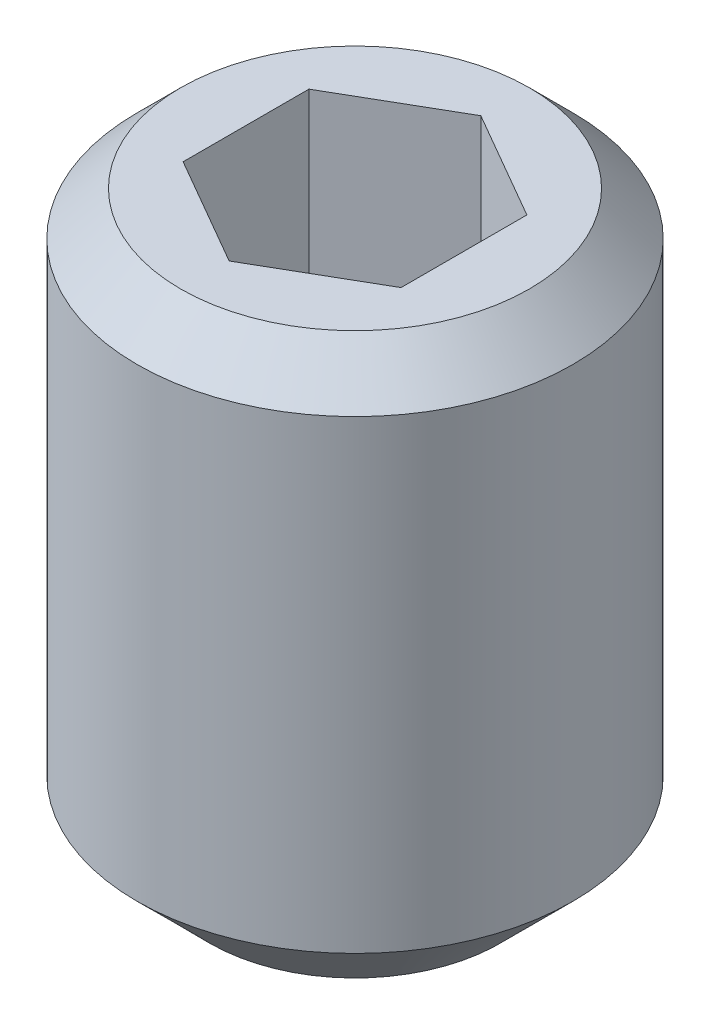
ISO-10303-21;
HEADER;
FILE_DESCRIPTION(('STEP AP214'),'2;1');
FILE_NAME('part.step','',(''),(''),'','','');
FILE_SCHEMA(('AUTOMOTIVE_DESIGN { 1 0 10303 214 1 1 1 1 }'));
ENDSEC;
DATA;
#1=APPLICATION_CONTEXT('core data for automotive mechanical design processes');
#2=APPLICATION_PROTOCOL_DEFINITION('international standard','automotive_design',2000,#1);
#3=PRODUCT_CONTEXT('',#1,'mechanical');
#4=PRODUCT('Part','Part','',(#3));
#5=PRODUCT_RELATED_PRODUCT_CATEGORY('part','',(#4));
#6=PRODUCT_DEFINITION_FORMATION('','',#4);
#7=PRODUCT_DEFINITION_CONTEXT('part definition',#1,'design');
#8=PRODUCT_DEFINITION('design','',#6,#7);
#9=PRODUCT_DEFINITION_SHAPE('','',#8);
#10=(LENGTH_UNIT() NAMED_UNIT(*) SI_UNIT(.MILLI.,.METRE.));
#11=(NAMED_UNIT(*) PLANE_ANGLE_UNIT() SI_UNIT($,.RADIAN.));
#12=(NAMED_UNIT(*) SI_UNIT($,.STERADIAN.) SOLID_ANGLE_UNIT());
#13=UNCERTAINTY_MEASURE_WITH_UNIT(LENGTH_MEASURE(1.E-05),#10,'distance_accuracy_value','');
#14=(GEOMETRIC_REPRESENTATION_CONTEXT(3) GLOBAL_UNCERTAINTY_ASSIGNED_CONTEXT((#13)) GLOBAL_UNIT_ASSIGNED_CONTEXT((#10,
#11,#12)) REPRESENTATION_CONTEXT('',''));
#15=CARTESIAN_POINT('',(0.,0.,0.));
#16=DIRECTION('',(0.,0.,1.));
#17=DIRECTION('',(1.,0.,0.));
#18=AXIS2_PLACEMENT_3D('',#15,#16,#17);
#19=CARTESIAN_POINT('',(0.,-0.300000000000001,0.));
#20=DIRECTION('',(0.,-1.,0.));
#21=DIRECTION('',(0.,0.,-1.));
#22=AXIS2_PLACEMENT_3D('',#19,#20,#21);
#23=CONICAL_SURFACE('',#22,1.5,0.785398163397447);
#24=CARTESIAN_POINT('',(0.,0.,0.));
#25=DIRECTION('',(0.,-1.,0.));
#26=DIRECTION('',(0.,0.,-1.));
#27=AXIS2_PLACEMENT_3D('',#24,#25,#26);
#28=CIRCLE('',#27,1.2);
#29=CARTESIAN_POINT('',(0.,0.,-1.2));
#30=VERTEX_POINT('',#29);
#31=EDGE_CURVE('E11',#30,#30,#28,.T.);
#32=ORIENTED_EDGE('',*,*,#31,.T.);
#33=EDGE_LOOP('',(#32));
#34=FACE_BOUND('',#33,.T.);
#35=CARTESIAN_POINT('',(0.,-0.300000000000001,0.));
#36=DIRECTION('',(0.,-1.,0.));
#37=DIRECTION('',(0.,0.,-1.));
#38=AXIS2_PLACEMENT_3D('',#35,#36,#37);
#39=CIRCLE('',#38,1.5);
#40=CARTESIAN_POINT('',(0.,-0.300000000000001,-1.5));
#41=VERTEX_POINT('',#40);
#42=EDGE_CURVE('E161',#41,#41,#39,.T.);
#43=ORIENTED_EDGE('',*,*,#42,.F.);
#44=EDGE_LOOP('',(#43));
#45=FACE_BOUND('',#44,.T.);
#46=ADVANCED_FACE('F33',(#34,#45),#23,.T.);
#47=CARTESIAN_POINT('',(0.75,0.,0.));
#48=DIRECTION('',(0.,1.,0.));
#49=DIRECTION('',(0.,0.,1.));
#50=AXIS2_PLACEMENT_3D('',#47,#48,#49);
#51=PLANE('',#50);
#52=DIRECTION('',(-0.86602540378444,0.,0.499999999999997));
#53=VECTOR('',#52,1.);
#54=CARTESIAN_POINT('',(-0.75,0.,-0.433012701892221));
#55=LINE('',#54,#53);
#56=CARTESIAN_POINT('',(0.,0.,-0.866025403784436));
#57=VERTEX_POINT('',#56);
#58=CARTESIAN_POINT('',(-0.75,0.,-0.433012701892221));
#59=VERTEX_POINT('',#58);
#60=EDGE_CURVE('E154',#57,#59,#55,.T.);
#61=ORIENTED_EDGE('',*,*,#60,.F.);
#62=DIRECTION('',(-0.86602540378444,0.,-0.499999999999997));
#63=VECTOR('',#62,1.);
#64=CARTESIAN_POINT('',(0.75,0.,-0.433012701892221));
#65=LINE('',#64,#63);
#66=CARTESIAN_POINT('',(0.75,0.,-0.433012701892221));
#67=VERTEX_POINT('',#66);
#68=EDGE_CURVE('E151',#67,#57,#65,.T.);
#69=ORIENTED_EDGE('',*,*,#68,.F.);
#70=DIRECTION('',(0.,0.,-1.));
#71=VECTOR('',#70,1.);
#72=CARTESIAN_POINT('',(0.75,0.,-0.433012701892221));
#73=LINE('',#72,#71);
#74=CARTESIAN_POINT('',(0.75,0.,0.433012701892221));
#75=VERTEX_POINT('',#74);
#76=EDGE_CURVE('E149',#75,#67,#73,.T.);
#77=ORIENTED_EDGE('',*,*,#76,.F.);
#78=DIRECTION('',(0.86602540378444,0.,-0.499999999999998));
#79=VECTOR('',#78,1.);
#80=CARTESIAN_POINT('',(0.75,0.,0.433012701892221));
#81=LINE('',#80,#79);
#82=CARTESIAN_POINT('',(0.,0.,0.866025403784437));
#83=VERTEX_POINT('',#82);
#84=EDGE_CURVE('E147',#83,#75,#81,.T.);
#85=ORIENTED_EDGE('',*,*,#84,.F.);
#86=DIRECTION('',(0.86602540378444,0.,0.499999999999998));
#87=VECTOR('',#86,1.);
#88=CARTESIAN_POINT('',(-0.75,0.,0.433012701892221));
#89=LINE('',#88,#87);
#90=CARTESIAN_POINT('',(-0.75,0.,0.433012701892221));
#91=VERTEX_POINT('',#90);
#92=EDGE_CURVE('E121',#91,#83,#89,.T.);
#93=ORIENTED_EDGE('',*,*,#92,.F.);
#94=DIRECTION('',(0.,0.,1.));
#95=VECTOR('',#94,1.);
#96=CARTESIAN_POINT('',(-0.75,0.,-0.433012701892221));
#97=LINE('',#96,#95);
#98=EDGE_CURVE('E114',#59,#91,#97,.T.);
#99=ORIENTED_EDGE('',*,*,#98,.F.);
#100=EDGE_LOOP('',(#61,#69,#77,#85,#93,#99));
#101=FACE_BOUND('',#100,.T.);
#102=ORIENTED_EDGE('',*,*,#31,.F.);
#103=EDGE_LOOP('',(#102));
#104=FACE_BOUND('',#103,.T.);
#105=ADVANCED_FACE('F228',(#101,#104),#51,.T.);
#106=CARTESIAN_POINT('',(0.,-4.,0.));
#107=DIRECTION('',(0.,-1.,0.));
#108=DIRECTION('',(0.,0.,-1.));
#109=AXIS2_PLACEMENT_3D('',#106,#107,#108);
#110=PLANE('',#109);
#111=CARTESIAN_POINT('',(0.,-4.,0.));
#112=DIRECTION('',(0.,-1.,0.));
#113=DIRECTION('',(0.,0.,-1.));
#114=AXIS2_PLACEMENT_3D('',#111,#112,#113);
#115=CIRCLE('',#114,1.);
#116=CARTESIAN_POINT('',(0.,-4.,-1.));
#117=VERTEX_POINT('',#116);
#118=EDGE_CURVE('E178',#117,#117,#115,.T.);
#119=ORIENTED_EDGE('',*,*,#118,.T.);
#120=EDGE_LOOP('',(#119));
#121=FACE_BOUND('',#120,.T.);
#122=ADVANCED_FACE('F233',(#121),#110,.T.);
#123=CARTESIAN_POINT('',(0.,-4.,0.));
#124=DIRECTION('',(0.,1.,0.));
#125=DIRECTION('',(0.,0.,1.));
#126=AXIS2_PLACEMENT_3D('',#123,#124,#125);
#127=CONICAL_SURFACE('',#126,1.,0.785398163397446);
#128=CARTESIAN_POINT('',(0.,-3.5,0.));
#129=DIRECTION('',(0.,-1.,0.));
#130=DIRECTION('',(0.,0.,-1.));
#131=AXIS2_PLACEMENT_3D('',#128,#129,#130);
#132=CIRCLE('',#131,1.5);
#133=CARTESIAN_POINT('',(0.,-3.5,-1.5));
#134=VERTEX_POINT('',#133);
#135=EDGE_CURVE('E175',#134,#134,#132,.T.);
#136=ORIENTED_EDGE('',*,*,#135,.T.);
#137=EDGE_LOOP('',(#136));
#138=FACE_BOUND('',#137,.T.);
#139=ORIENTED_EDGE('',*,*,#118,.F.);
#140=EDGE_LOOP('',(#139));
#141=FACE_BOUND('',#140,.T.);
#142=ADVANCED_FACE('F242',(#138,#141),#127,.T.);
#143=CARTESIAN_POINT('',(0.,-4.,0.));
#144=DIRECTION('',(0.,-1.,0.));
#145=DIRECTION('',(0.,0.,-1.));
#146=AXIS2_PLACEMENT_3D('',#143,#144,#145);
#147=CYLINDRICAL_SURFACE('',#146,1.5);
#148=ORIENTED_EDGE('',*,*,#42,.T.);
#149=EDGE_LOOP('',(#148));
#150=FACE_BOUND('',#149,.T.);
#151=ORIENTED_EDGE('',*,*,#135,.F.);
#152=EDGE_LOOP('',(#151));
#153=FACE_BOUND('',#152,.T.);
#154=ADVANCED_FACE('F239',(#150,#153),#147,.T.);
#155=CARTESIAN_POINT('',(-0.75,-1.5,0.433012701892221));
#156=DIRECTION('',(-0.499999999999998,0.,0.86602540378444));
#157=DIRECTION('',(0.86602540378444,0.,0.499999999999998));
#158=AXIS2_PLACEMENT_3D('',#155,#156,#157);
#159=PLANE('',#158);
#160=ORIENTED_EDGE('',*,*,#92,.T.);
#161=DIRECTION('',(0.,1.,0.));
#162=VECTOR('',#161,1.);
#163=CARTESIAN_POINT('',(0.,-1.5,0.866025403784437));
#164=LINE('',#163,#162);
#165=CARTESIAN_POINT('',(0.,-1.5,0.866025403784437));
#166=VERTEX_POINT('',#165);
#167=EDGE_CURVE('E118',#166,#83,#164,.T.);
#168=ORIENTED_EDGE('',*,*,#167,.F.);
#169=DIRECTION('',(0.86602540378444,0.,0.499999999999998));
#170=VECTOR('',#169,1.);
#171=CARTESIAN_POINT('',(-0.75,-1.5,0.433012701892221));
#172=LINE('',#171,#170);
#173=CARTESIAN_POINT('',(-0.374999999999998,-1.5,0.64951905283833));
#174=VERTEX_POINT('',#173);
#175=EDGE_CURVE('E103',#174,#166,#172,.T.);
#176=ORIENTED_EDGE('',*,*,#175,.F.);
#177=CARTESIAN_POINT('',(-0.75,-1.5,0.433012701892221));
#178=VERTEX_POINT('',#177);
#179=EDGE_CURVE('E113',#178,#174,#172,.T.);
#180=ORIENTED_EDGE('',*,*,#179,.F.);
#181=DIRECTION('',(0.,1.,0.));
#182=VECTOR('',#181,1.);
#183=CARTESIAN_POINT('',(-0.75,-1.5,0.433012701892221));
#184=LINE('',#183,#182);
#185=EDGE_CURVE('E159',#178,#91,#184,.T.);
#186=ORIENTED_EDGE('',*,*,#185,.T.);
#187=EDGE_LOOP('',(#160,#168,#176,#180,#186));
#188=FACE_BOUND('',#187,.T.);
#189=ADVANCED_FACE('F119',(#188),#159,.F.);
#190=CARTESIAN_POINT('',(-0.75,-1.5,-0.433012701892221));
#191=DIRECTION('',(-1.,0.,0.));
#192=DIRECTION('',(0.,0.,1.));
#193=AXIS2_PLACEMENT_3D('',#190,#191,#192);
#194=PLANE('',#193);
#195=ORIENTED_EDGE('',*,*,#98,.T.);
#196=ORIENTED_EDGE('',*,*,#185,.F.);
#197=DIRECTION('',(0.,0.,1.));
#198=VECTOR('',#197,1.);
#199=CARTESIAN_POINT('',(-0.75,-1.5,-0.433012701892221));
#200=LINE('',#199,#198);
#201=CARTESIAN_POINT('',(-0.749999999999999,-1.5,0.));
#202=VERTEX_POINT('',#201);
#203=EDGE_CURVE('E143',#202,#178,#200,.T.);
#204=ORIENTED_EDGE('',*,*,#203,.F.);
#205=CARTESIAN_POINT('',(-0.75,-1.5,-0.433012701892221));
#206=VERTEX_POINT('',#205);
#207=EDGE_CURVE('E125',#206,#202,#200,.T.);
#208=ORIENTED_EDGE('',*,*,#207,.F.);
#209=DIRECTION('',(0.,1.,0.));
#210=VECTOR('',#209,1.);
#211=CARTESIAN_POINT('',(-0.75,-1.5,-0.433012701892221));
#212=LINE('',#211,#210);
#213=EDGE_CURVE('E162',#206,#59,#212,.T.);
#214=ORIENTED_EDGE('',*,*,#213,.T.);
#215=EDGE_LOOP('',(#195,#196,#204,#208,#214));
#216=FACE_BOUND('',#215,.T.);
#217=ADVANCED_FACE('F200',(#216),#194,.F.);
#218=CARTESIAN_POINT('',(-0.75,-1.5,-0.433012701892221));
#219=DIRECTION('',(-0.499999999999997,0.,-0.86602540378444));
#220=DIRECTION('',(-0.86602540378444,0.,0.499999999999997));
#221=AXIS2_PLACEMENT_3D('',#218,#219,#220);
#222=PLANE('',#221);
#223=ORIENTED_EDGE('',*,*,#60,.T.);
#224=ORIENTED_EDGE('',*,*,#213,.F.);
#225=DIRECTION('',(-0.86602540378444,0.,0.499999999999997));
#226=VECTOR('',#225,1.);
#227=CARTESIAN_POINT('',(-0.75,-1.5,-0.433012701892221));
#228=LINE('',#227,#226);
#229=CARTESIAN_POINT('',(-0.374999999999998,-1.5,-0.64951905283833));
#230=VERTEX_POINT('',#229);
#231=EDGE_CURVE('E141',#230,#206,#228,.T.);
#232=ORIENTED_EDGE('',*,*,#231,.F.);
#233=CARTESIAN_POINT('',(0.,-1.5,-0.866025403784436));
#234=VERTEX_POINT('',#233);
#235=EDGE_CURVE('E47',#234,#230,#228,.T.);
#236=ORIENTED_EDGE('',*,*,#235,.F.);
#237=DIRECTION('',(0.,1.,0.));
#238=VECTOR('',#237,1.);
#239=CARTESIAN_POINT('',(0.,-1.5,-0.866025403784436));
#240=LINE('',#239,#238);
#241=EDGE_CURVE('E165',#234,#57,#240,.T.);
#242=ORIENTED_EDGE('',*,*,#241,.T.);
#243=EDGE_LOOP('',(#223,#224,#232,#236,#242));
#244=FACE_BOUND('',#243,.T.);
#245=ADVANCED_FACE('F264',(#244),#222,.F.);
#246=CARTESIAN_POINT('',(0.75,-1.5,-0.433012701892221));
#247=DIRECTION('',(0.499999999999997,0.,-0.86602540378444));
#248=DIRECTION('',(-0.86602540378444,0.,-0.499999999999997));
#249=AXIS2_PLACEMENT_3D('',#246,#247,#248);
#250=PLANE('',#249);
#251=ORIENTED_EDGE('',*,*,#68,.T.);
#252=ORIENTED_EDGE('',*,*,#241,.F.);
#253=DIRECTION('',(-0.86602540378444,0.,-0.499999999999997));
#254=VECTOR('',#253,1.);
#255=CARTESIAN_POINT('',(0.75,-1.5,-0.433012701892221));
#256=LINE('',#255,#254);
#257=CARTESIAN_POINT('',(0.374999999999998,-1.5,-0.64951905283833));
#258=VERTEX_POINT('',#257);
#259=EDGE_CURVE('E137',#258,#234,#256,.T.);
#260=ORIENTED_EDGE('',*,*,#259,.F.);
#261=CARTESIAN_POINT('',(0.75,-1.5,-0.433012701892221));
#262=VERTEX_POINT('',#261);
#263=EDGE_CURVE('E138',#262,#258,#256,.T.);
#264=ORIENTED_EDGE('',*,*,#263,.F.);
#265=DIRECTION('',(0.,1.,0.));
#266=VECTOR('',#265,1.);
#267=CARTESIAN_POINT('',(0.75,-1.5,-0.433012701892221));
#268=LINE('',#267,#266);
#269=EDGE_CURVE('E168',#262,#67,#268,.T.);
#270=ORIENTED_EDGE('',*,*,#269,.T.);
#271=EDGE_LOOP('',(#251,#252,#260,#264,#270));
#272=FACE_BOUND('',#271,.T.);
#273=ADVANCED_FACE('F214',(#272),#250,.F.);
#274=CARTESIAN_POINT('',(0.75,-1.5,-0.433012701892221));
#275=DIRECTION('',(1.,0.,0.));
#276=DIRECTION('',(0.,0.,-1.));
#277=AXIS2_PLACEMENT_3D('',#274,#275,#276);
#278=PLANE('',#277);
#279=ORIENTED_EDGE('',*,*,#76,.T.);
#280=ORIENTED_EDGE('',*,*,#269,.F.);
#281=DIRECTION('',(0.,0.,-1.));
#282=VECTOR('',#281,1.);
#283=CARTESIAN_POINT('',(0.75,-1.5,-0.433012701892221));
#284=LINE('',#283,#282);
#285=CARTESIAN_POINT('',(0.749999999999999,-1.5,0.));
#286=VERTEX_POINT('',#285);
#287=EDGE_CURVE('E131',#286,#262,#284,.T.);
#288=ORIENTED_EDGE('',*,*,#287,.F.);
#289=CARTESIAN_POINT('',(0.75,-1.5,0.433012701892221));
#290=VERTEX_POINT('',#289);
#291=EDGE_CURVE('E133',#290,#286,#284,.T.);
#292=ORIENTED_EDGE('',*,*,#291,.F.);
#293=DIRECTION('',(0.,1.,0.));
#294=VECTOR('',#293,1.);
#295=CARTESIAN_POINT('',(0.75,-1.5,0.433012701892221));
#296=LINE('',#295,#294);
#297=EDGE_CURVE('E124',#290,#75,#296,.T.);
#298=ORIENTED_EDGE('',*,*,#297,.T.);
#299=EDGE_LOOP('',(#279,#280,#288,#292,#298));
#300=FACE_BOUND('',#299,.T.);
#301=ADVANCED_FACE('F209',(#300),#278,.F.);
#302=CARTESIAN_POINT('',(0.75,-1.5,0.433012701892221));
#303=DIRECTION('',(0.499999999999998,0.,0.86602540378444));
#304=DIRECTION('',(0.86602540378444,0.,-0.499999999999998));
#305=AXIS2_PLACEMENT_3D('',#302,#303,#304);
#306=PLANE('',#305);
#307=ORIENTED_EDGE('',*,*,#84,.T.);
#308=ORIENTED_EDGE('',*,*,#297,.F.);
#309=DIRECTION('',(0.86602540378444,0.,-0.499999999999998));
#310=VECTOR('',#309,1.);
#311=CARTESIAN_POINT('',(0.75,-1.5,0.433012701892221));
#312=LINE('',#311,#310);
#313=CARTESIAN_POINT('',(0.374999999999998,-1.5,0.64951905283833));
#314=VERTEX_POINT('',#313);
#315=EDGE_CURVE('E130',#314,#290,#312,.T.);
#316=ORIENTED_EDGE('',*,*,#315,.F.);
#317=EDGE_CURVE('E107',#166,#314,#312,.T.);
#318=ORIENTED_EDGE('',*,*,#317,.F.);
#319=ORIENTED_EDGE('',*,*,#167,.T.);
#320=EDGE_LOOP('',(#307,#308,#316,#318,#319));
#321=FACE_BOUND('',#320,.T.);
#322=ADVANCED_FACE('F128',(#321),#306,.F.);
#323=CARTESIAN_POINT('',(0.75,-1.5,1.29903810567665));
#324=DIRECTION('',(0.,-1.,0.));
#325=DIRECTION('',(0.,0.,-1.));
#326=AXIS2_PLACEMENT_3D('',#323,#324,#325);
#327=PLANE('',#326);
#328=CARTESIAN_POINT('',(0.,-1.5,0.));
#329=DIRECTION('',(0.,-1.,0.));
#330=DIRECTION('',(0.,0.,-1.));
#331=AXIS2_PLACEMENT_3D('',#328,#329,#330);
#332=CIRCLE('',#331,0.75);
#333=EDGE_CURVE('E40',#258,#286,#332,.T.);
#334=ORIENTED_EDGE('',*,*,#333,.T.);
#335=ORIENTED_EDGE('',*,*,#287,.T.);
#336=ORIENTED_EDGE('',*,*,#263,.T.);
#337=EDGE_LOOP('',(#334,#335,#336));
#338=FACE_BOUND('',#337,.T.);
#339=ADVANCED_FACE('F212',(#338),#327,.F.);
#340=EDGE_CURVE('E181',#286,#314,#332,.T.);
#341=ORIENTED_EDGE('',*,*,#340,.T.);
#342=ORIENTED_EDGE('',*,*,#315,.T.);
#343=ORIENTED_EDGE('',*,*,#291,.T.);
#344=EDGE_LOOP('',(#341,#342,#343));
#345=FACE_BOUND('',#344,.T.);
#346=ADVANCED_FACE('F206',(#345),#327,.F.);
#347=EDGE_CURVE('E109',#314,#174,#332,.T.);
#348=ORIENTED_EDGE('',*,*,#347,.T.);
#349=ORIENTED_EDGE('',*,*,#175,.T.);
#350=ORIENTED_EDGE('',*,*,#317,.T.);
#351=EDGE_LOOP('',(#348,#349,#350));
#352=FACE_BOUND('',#351,.T.);
#353=ADVANCED_FACE('F105',(#352),#327,.F.);
#354=EDGE_CURVE('E189',#174,#202,#332,.T.);
#355=ORIENTED_EDGE('',*,*,#354,.T.);
#356=ORIENTED_EDGE('',*,*,#203,.T.);
#357=ORIENTED_EDGE('',*,*,#179,.T.);
#358=EDGE_LOOP('',(#355,#356,#357));
#359=FACE_BOUND('',#358,.T.);
#360=ADVANCED_FACE('F195',(#359),#327,.F.);
#361=EDGE_CURVE('E185',#202,#230,#332,.T.);
#362=ORIENTED_EDGE('',*,*,#361,.T.);
#363=ORIENTED_EDGE('',*,*,#231,.T.);
#364=ORIENTED_EDGE('',*,*,#207,.T.);
#365=EDGE_LOOP('',(#362,#363,#364));
#366=FACE_BOUND('',#365,.T.);
#367=ADVANCED_FACE('F201',(#366),#327,.F.);
#368=EDGE_CURVE('E180',#230,#258,#332,.T.);
#369=ORIENTED_EDGE('',*,*,#368,.T.);
#370=ORIENTED_EDGE('',*,*,#259,.T.);
#371=ORIENTED_EDGE('',*,*,#235,.T.);
#372=EDGE_LOOP('',(#369,#370,#371));
#373=FACE_BOUND('',#372,.T.);
#374=ADVANCED_FACE('F217',(#373),#327,.F.);
#375=CARTESIAN_POINT('',(0.,-1.5,0.));
#376=DIRECTION('',(0.,1.,0.));
#377=DIRECTION('',(0.,0.,1.));
#378=AXIS2_PLACEMENT_3D('',#375,#376,#377);
#379=CONICAL_SURFACE('',#378,0.75,1.0471975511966);
#380=CARTESIAN_POINT('',(0.,-1.93301270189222,0.));
#381=VERTEX_POINT('',#380);
#382=VERTEX_LOOP('',#381);
#383=FACE_BOUND('',#382,.T.);
#384=ORIENTED_EDGE('',*,*,#333,.F.);
#385=ORIENTED_EDGE('',*,*,#368,.F.);
#386=ORIENTED_EDGE('',*,*,#361,.F.);
#387=ORIENTED_EDGE('',*,*,#354,.F.);
#388=ORIENTED_EDGE('',*,*,#347,.F.);
#389=ORIENTED_EDGE('',*,*,#340,.F.);
#390=EDGE_LOOP('',(#384,#385,#386,#387,#388,#389));
#391=FACE_BOUND('',#390,.T.);
#392=ADVANCED_FACE('F203',(#383,#391),#379,.F.);
#393=CLOSED_SHELL('',(#46,#105,#122,#142,#154,#189,#217,#245,#273,#301,#322,#339,#346,#353,#360,
#367,#374,#392));
#394=MANIFOLD_SOLID_BREP('B2',#393);
#395=ADVANCED_BREP_SHAPE_REPRESENTATION('',(#18,#394),#14);
#396=SHAPE_DEFINITION_REPRESENTATION(#9,#395);
ENDSEC;
END-ISO-10303-21;
